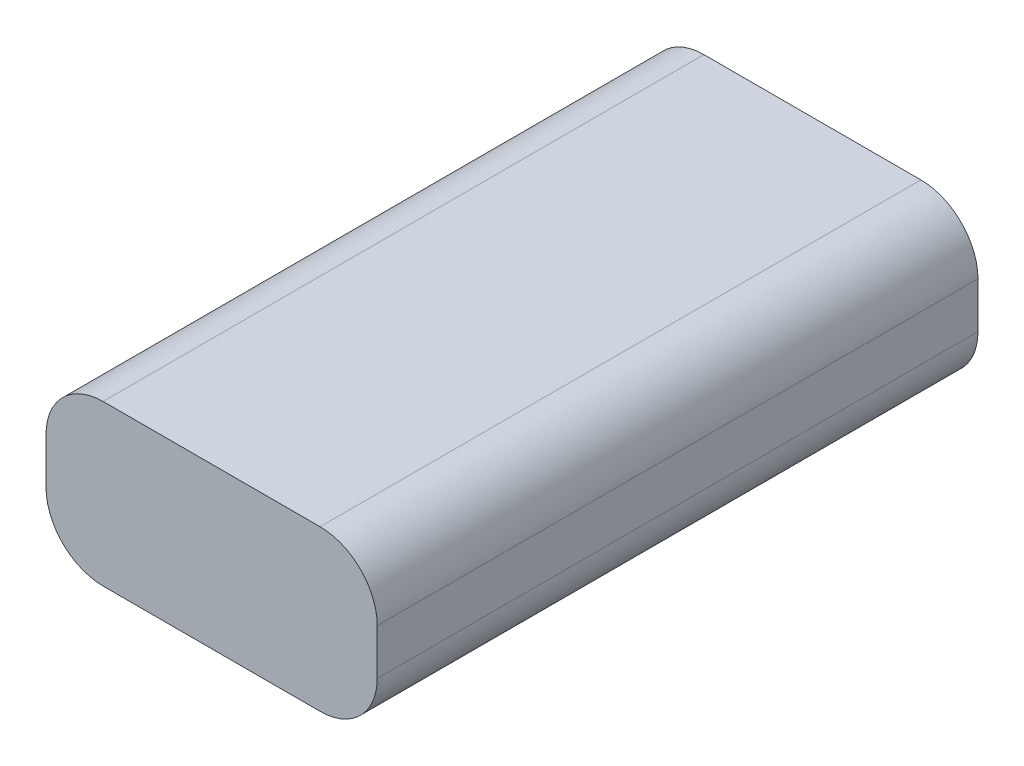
from build123d import *

# Parameters (mm, degrees)
SKETCH1_W           = 36.83
SKETCH1_H           = 66.802
BOSS_EXTRUDE1_DEPTH = 17.78
FILLET1_R           = 6.35


with BuildPart() as part:
    # Sketch1 → Boss-Extrude1 (new body)
    with BuildSketch(Plane(origin=(0, 0, 0), x_dir=(1, 0, 0), z_dir=(0, 1, 0))):
        Rectangle(SKETCH1_W, SKETCH1_H)
    extrude(amount=BOSS_EXTRUDE1_DEPTH)

    # Fillet1
    fillet1_edges = [part.edges().sort_by_distance(p)[0] for p in [
        (18.415, 17.78, 0),
        (-18.415, 17.78, 0),
        (18.415, 0, 0),
        (-18.415, 0, 0),
    ]]
    fillet(fillet1_edges, radius=FILLET1_R)


solid = part.part
